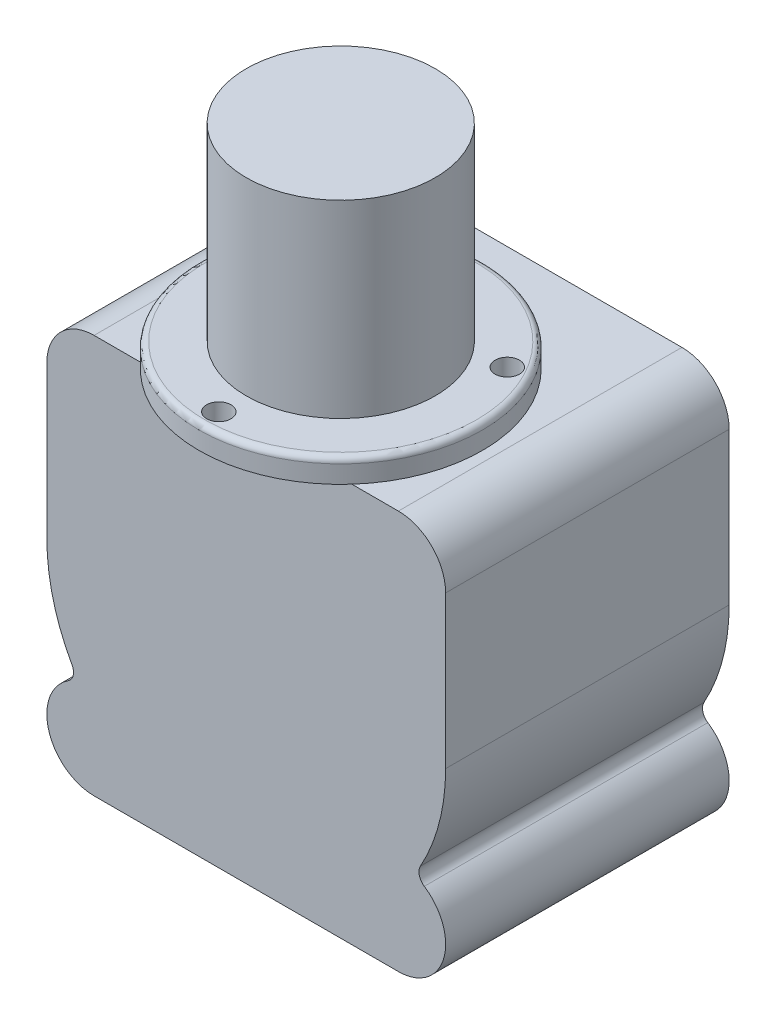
ISO-10303-21;
HEADER;
FILE_DESCRIPTION(('STEP AP214'),'2;1');
FILE_NAME('part.step','',(''),(''),'','','');
FILE_SCHEMA(('AUTOMOTIVE_DESIGN { 1 0 10303 214 1 1 1 1 }'));
ENDSEC;
DATA;
#1=APPLICATION_CONTEXT('core data for automotive mechanical design processes');
#2=APPLICATION_PROTOCOL_DEFINITION('international standard','automotive_design',2000,#1);
#3=PRODUCT_CONTEXT('',#1,'mechanical');
#4=PRODUCT('Part','Part','',(#3));
#5=PRODUCT_RELATED_PRODUCT_CATEGORY('part','',(#4));
#6=PRODUCT_DEFINITION_FORMATION('','',#4);
#7=PRODUCT_DEFINITION_CONTEXT('part definition',#1,'design');
#8=PRODUCT_DEFINITION('design','',#6,#7);
#9=PRODUCT_DEFINITION_SHAPE('','',#8);
#10=(LENGTH_UNIT() NAMED_UNIT(*) SI_UNIT(.MILLI.,.METRE.));
#11=(NAMED_UNIT(*) PLANE_ANGLE_UNIT() SI_UNIT($,.RADIAN.));
#12=(NAMED_UNIT(*) SI_UNIT($,.STERADIAN.) SOLID_ANGLE_UNIT());
#13=UNCERTAINTY_MEASURE_WITH_UNIT(LENGTH_MEASURE(1.E-05),#10,'distance_accuracy_value','');
#14=(GEOMETRIC_REPRESENTATION_CONTEXT(3) GLOBAL_UNCERTAINTY_ASSIGNED_CONTEXT((#13)) GLOBAL_UNIT_ASSIGNED_CONTEXT((#10,
#11,#12)) REPRESENTATION_CONTEXT('',''));
#15=CARTESIAN_POINT('',(0.,0.,0.));
#16=DIRECTION('',(0.,0.,1.));
#17=DIRECTION('',(1.,0.,0.));
#18=AXIS2_PLACEMENT_3D('',#15,#16,#17);
#19=CARTESIAN_POINT('',(-14.1880941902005,23.6220000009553,17.2085));
#20=DIRECTION('',(0.,1.,0.));
#21=DIRECTION('',(0.,0.,1.));
#22=AXIS2_PLACEMENT_3D('',#19,#20,#21);
#23=CONICAL_SURFACE('',#22,1.63829999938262,1.02974425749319);
#24=CARTESIAN_POINT('',(-14.1880941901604,22.6376100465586,17.2085));
#25=VERTEX_POINT('',#24);
#26=VERTEX_LOOP('',#25);
#27=FACE_BOUND('',#26,.T.);
#28=CARTESIAN_POINT('',(-14.1880941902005,23.622,17.2085));
#29=DIRECTION('',(0.,1.,0.));
#30=DIRECTION('',(0.,0.,1.));
#31=AXIS2_PLACEMENT_3D('',#28,#29,#30);
#32=CIRCLE('',#31,1.6383);
#33=CARTESIAN_POINT('',(-14.1880941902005,23.622,18.8468));
#34=VERTEX_POINT('',#33);
#35=EDGE_CURVE('E197',#34,#34,#32,.T.);
#36=ORIENTED_EDGE('',*,*,#35,.T.);
#37=EDGE_LOOP('',(#36));
#38=FACE_BOUND('',#37,.T.);
#39=ADVANCED_FACE('F16',(#27,#38),#23,.F.);
#40=CARTESIAN_POINT('',(14.1880941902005,23.6220000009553,17.2085));
#41=DIRECTION('',(0.,1.,0.));
#42=DIRECTION('',(0.,0.,1.));
#43=AXIS2_PLACEMENT_3D('',#40,#41,#42);
#44=CONICAL_SURFACE('',#43,1.63829999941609,1.02974425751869);
#45=CARTESIAN_POINT('',(14.1880941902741,22.6376100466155,17.2085));
#46=VERTEX_POINT('',#45);
#47=VERTEX_LOOP('',#46);
#48=FACE_BOUND('',#47,.T.);
#49=CARTESIAN_POINT('',(14.1880941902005,23.622,17.2085));
#50=DIRECTION('',(0.,1.,0.));
#51=DIRECTION('',(0.,0.,1.));
#52=AXIS2_PLACEMENT_3D('',#49,#50,#51);
#53=CIRCLE('',#52,1.6383);
#54=CARTESIAN_POINT('',(14.1880941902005,23.622,18.8468));
#55=VERTEX_POINT('',#54);
#56=EDGE_CURVE('E189',#55,#55,#53,.T.);
#57=ORIENTED_EDGE('',*,*,#56,.T.);
#58=EDGE_LOOP('',(#57));
#59=FACE_BOUND('',#58,.T.);
#60=ADVANCED_FACE('F269',(#48,#59),#44,.F.);
#61=CARTESIAN_POINT('',(0.,55.372,25.4));
#62=DIRECTION('',(0.,-1.,0.));
#63=DIRECTION('',(0.,0.,-1.));
#64=AXIS2_PLACEMENT_3D('',#61,#62,#63);
#65=PLANE('',#64);
#66=CARTESIAN_POINT('',(0.,55.372,25.4));
#67=DIRECTION('',(0.,1.,0.));
#68=DIRECTION('',(0.,0.,1.));
#69=AXIS2_PLACEMENT_3D('',#66,#67,#68);
#70=CIRCLE('',#69,12.7);
#71=CARTESIAN_POINT('',(0.,55.372,38.1));
#72=VERTEX_POINT('',#71);
#73=EDGE_CURVE('E19',#72,#72,#70,.F.);
#74=ORIENTED_EDGE('',*,*,#73,.F.);
#75=EDGE_LOOP('',(#74));
#76=FACE_BOUND('',#75,.T.);
#77=ADVANCED_FACE('F266',(#76),#65,.F.);
#78=CARTESIAN_POINT('',(-14.1880941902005,26.797,17.2085));
#79=DIRECTION('',(0.,1.,0.));
#80=DIRECTION('',(0.,0.,1.));
#81=AXIS2_PLACEMENT_3D('',#78,#79,#80);
#82=CYLINDRICAL_SURFACE('',#81,1.6383);
#83=ORIENTED_EDGE('',*,*,#35,.F.);
#84=EDGE_LOOP('',(#83));
#85=FACE_BOUND('',#84,.T.);
#86=CARTESIAN_POINT('',(-14.1880941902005,29.972,17.2085));
#87=DIRECTION('',(0.,1.,0.));
#88=DIRECTION('',(0.,0.,1.));
#89=AXIS2_PLACEMENT_3D('',#86,#87,#88);
#90=CIRCLE('',#89,1.6383);
#91=CARTESIAN_POINT('',(-14.1880941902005,29.972,18.8468));
#92=VERTEX_POINT('',#91);
#93=EDGE_CURVE('E257',#92,#92,#90,.T.);
#94=ORIENTED_EDGE('',*,*,#93,.T.);
#95=EDGE_LOOP('',(#94));
#96=FACE_BOUND('',#95,.T.);
#97=ADVANCED_FACE('F268',(#85,#96),#82,.F.);
#98=CARTESIAN_POINT('',(14.1880941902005,26.797,17.2085));
#99=DIRECTION('',(0.,1.,0.));
#100=DIRECTION('',(0.,0.,1.));
#101=AXIS2_PLACEMENT_3D('',#98,#99,#100);
#102=CYLINDRICAL_SURFACE('',#101,1.6383);
#103=ORIENTED_EDGE('',*,*,#56,.F.);
#104=EDGE_LOOP('',(#103));
#105=FACE_BOUND('',#104,.T.);
#106=CARTESIAN_POINT('',(14.1880941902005,29.972,17.2085));
#107=DIRECTION('',(0.,1.,0.));
#108=DIRECTION('',(0.,0.,1.));
#109=AXIS2_PLACEMENT_3D('',#106,#107,#108);
#110=CIRCLE('',#109,1.6383);
#111=CARTESIAN_POINT('',(14.1880941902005,29.972,18.8468));
#112=VERTEX_POINT('',#111);
#113=EDGE_CURVE('E255',#112,#112,#110,.T.);
#114=ORIENTED_EDGE('',*,*,#113,.T.);
#115=EDGE_LOOP('',(#114));
#116=FACE_BOUND('',#115,.T.);
#117=ADVANCED_FACE('F276',(#105,#116),#102,.F.);
#118=CARTESIAN_POINT('',(0.,29.972,25.4));
#119=DIRECTION('',(0.,1.,0.));
#120=DIRECTION('',(0.,0.,1.));
#121=AXIS2_PLACEMENT_3D('',#118,#119,#120);
#122=CYLINDRICAL_SURFACE('',#121,12.7);
#123=CARTESIAN_POINT('',(0.,29.972,25.4));
#124=DIRECTION('',(0.,1.,0.));
#125=DIRECTION('',(0.,0.,1.));
#126=AXIS2_PLACEMENT_3D('',#123,#124,#125);
#127=CIRCLE('',#126,12.7);
#128=CARTESIAN_POINT('',(0.,29.972,38.1));
#129=VERTEX_POINT('',#128);
#130=EDGE_CURVE('E252',#129,#129,#127,.T.);
#131=ORIENTED_EDGE('',*,*,#130,.T.);
#132=EDGE_LOOP('',(#131));
#133=FACE_BOUND('',#132,.T.);
#134=ORIENTED_EDGE('',*,*,#73,.T.);
#135=EDGE_LOOP('',(#134));
#136=FACE_BOUND('',#135,.T.);
#137=ADVANCED_FACE('F264',(#133,#136),#122,.T.);
#138=CARTESIAN_POINT('',(0.,29.972,25.4));
#139=DIRECTION('',(0.,-1.,0.));
#140=DIRECTION('',(0.,0.,-1.));
#141=AXIS2_PLACEMENT_3D('',#138,#139,#140);
#142=PLANE('',#141);
#143=ORIENTED_EDGE('',*,*,#130,.F.);
#144=EDGE_LOOP('',(#143));
#145=FACE_BOUND('',#144,.T.);
#146=CARTESIAN_POINT('',(0.,29.972,41.783));
#147=DIRECTION('',(0.,1.,0.));
#148=DIRECTION('',(0.,0.,1.));
#149=AXIS2_PLACEMENT_3D('',#146,#147,#148);
#150=CIRCLE('',#149,1.6383);
#151=CARTESIAN_POINT('',(0.,29.972,43.4213));
#152=VERTEX_POINT('',#151);
#153=EDGE_CURVE('E249',#152,#152,#150,.F.);
#154=ORIENTED_EDGE('',*,*,#153,.T.);
#155=EDGE_LOOP('',(#154));
#156=FACE_BOUND('',#155,.T.);
#157=ORIENTED_EDGE('',*,*,#113,.F.);
#158=EDGE_LOOP('',(#157));
#159=FACE_BOUND('',#158,.T.);
#160=ORIENTED_EDGE('',*,*,#93,.F.);
#161=EDGE_LOOP('',(#160));
#162=FACE_BOUND('',#161,.T.);
#163=CARTESIAN_POINT('',(0.,29.972,25.4));
#164=DIRECTION('',(0.,-1.,0.));
#165=DIRECTION('',(1.,0.,0.));
#166=AXIS2_PLACEMENT_3D('',#163,#164,#165);
#167=CIRCLE('',#166,18.25625);
#168=CARTESIAN_POINT('',(18.25625,29.972,25.4));
#169=VERTEX_POINT('',#168);
#170=EDGE_CURVE('E248',#169,#169,#167,.T.);
#171=ORIENTED_EDGE('',*,*,#170,.F.);
#172=EDGE_LOOP('',(#171));
#173=FACE_BOUND('',#172,.T.);
#174=ADVANCED_FACE('F343',(#145,#156,#159,#162,#173),#142,.F.);
#175=CARTESIAN_POINT('',(0.,26.797,41.783));
#176=DIRECTION('',(0.,1.,0.));
#177=DIRECTION('',(0.,0.,1.));
#178=AXIS2_PLACEMENT_3D('',#175,#176,#177);
#179=CYLINDRICAL_SURFACE('',#178,1.6383);
#180=ORIENTED_EDGE('',*,*,#153,.F.);
#181=EDGE_LOOP('',(#180));
#182=FACE_BOUND('',#181,.T.);
#183=CARTESIAN_POINT('',(0.,26.797,41.783));
#184=DIRECTION('',(0.,1.,0.));
#185=DIRECTION('',(0.,0.,1.));
#186=AXIS2_PLACEMENT_3D('',#183,#184,#185);
#187=CIRCLE('',#186,1.6383);
#188=CARTESIAN_POINT('',(0.,26.797,43.4213));
#189=VERTEX_POINT('',#188);
#190=EDGE_CURVE('E124',#189,#189,#187,.T.);
#191=ORIENTED_EDGE('',*,*,#190,.F.);
#192=EDGE_LOOP('',(#191));
#193=FACE_BOUND('',#192,.T.);
#194=ADVANCED_FACE('F179',(#182,#193),#179,.F.);
#195=CARTESIAN_POINT('',(0.,29.17825,25.4));
#196=DIRECTION('',(0.,-1.,0.));
#197=DIRECTION('',(0.,0.,-1.));
#198=AXIS2_PLACEMENT_3D('',#195,#196,#197);
#199=TOROIDAL_SURFACE('',#198,18.25625,0.79375);
#200=CARTESIAN_POINT('',(0.,29.17825,25.4));
#201=DIRECTION('',(0.,1.,0.));
#202=DIRECTION('',(0.,0.,1.));
#203=AXIS2_PLACEMENT_3D('',#200,#201,#202);
#204=CIRCLE('',#203,19.05);
#205=CARTESIAN_POINT('',(0.,29.17825,44.45));
#206=VERTEX_POINT('',#205);
#207=EDGE_CURVE('E123',#206,#206,#204,.F.);
#208=ORIENTED_EDGE('',*,*,#207,.F.);
#209=EDGE_LOOP('',(#208));
#210=FACE_BOUND('',#209,.T.);
#211=ORIENTED_EDGE('',*,*,#170,.T.);
#212=EDGE_LOOP('',(#211));
#213=FACE_BOUND('',#212,.T.);
#214=ADVANCED_FACE('F174',(#210,#213),#199,.T.);
#215=CARTESIAN_POINT('',(0.,26.797,25.4));
#216=DIRECTION('',(0.,-1.,0.));
#217=DIRECTION('',(0.,0.,-1.));
#218=AXIS2_PLACEMENT_3D('',#215,#216,#217);
#219=PLANE('',#218);
#220=ORIENTED_EDGE('',*,*,#190,.T.);
#221=EDGE_LOOP('',(#220));
#222=FACE_BOUND('',#221,.T.);
#223=DIRECTION('',(1.,0.,0.));
#224=VECTOR('',#223,1.);
#225=CARTESIAN_POINT('',(0.,26.797,38.1));
#226=LINE('',#225,#224);
#227=CARTESIAN_POINT('',(14.1990316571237,26.797,38.1));
#228=VERTEX_POINT('',#227);
#229=CARTESIAN_POINT('',(-14.1990316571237,26.797,38.1));
#230=VERTEX_POINT('',#229);
#231=EDGE_CURVE('E112',#228,#230,#226,.F.);
#232=ORIENTED_EDGE('',*,*,#231,.F.);
#233=CARTESIAN_POINT('',(0.,26.797,25.4));
#234=DIRECTION('',(0.,1.,0.));
#235=DIRECTION('',(0.,0.,1.));
#236=AXIS2_PLACEMENT_3D('',#233,#234,#235);
#237=CIRCLE('',#236,19.05);
#238=EDGE_CURVE('E117',#230,#228,#237,.T.);
#239=ORIENTED_EDGE('',*,*,#238,.F.);
#240=EDGE_LOOP('',(#232,#239));
#241=FACE_BOUND('',#240,.T.);
#242=ADVANCED_FACE('F134',(#222,#241),#219,.T.);
#243=CARTESIAN_POINT('',(0.,26.797,25.4));
#244=DIRECTION('',(0.,1.,0.));
#245=DIRECTION('',(0.,0.,1.));
#246=AXIS2_PLACEMENT_3D('',#243,#244,#245);
#247=CYLINDRICAL_SURFACE('',#246,19.05);
#248=ORIENTED_EDGE('',*,*,#207,.T.);
#249=EDGE_LOOP('',(#248));
#250=FACE_BOUND('',#249,.T.);
#251=CARTESIAN_POINT('',(0.,26.797,25.4));
#252=DIRECTION('',(0.,1.,0.));
#253=DIRECTION('',(0.,0.,1.));
#254=AXIS2_PLACEMENT_3D('',#251,#252,#253);
#255=CIRCLE('',#254,19.05);
#256=EDGE_CURVE('E120',#230,#228,#255,.F.);
#257=ORIENTED_EDGE('',*,*,#256,.F.);
#258=ORIENTED_EDGE('',*,*,#238,.T.);
#259=EDGE_LOOP('',(#257,#258));
#260=FACE_BOUND('',#259,.T.);
#261=ADVANCED_FACE('F119',(#250,#260),#247,.T.);
#262=CARTESIAN_POINT('',(0.,0.,38.1));
#263=DIRECTION('',(0.,0.,1.));
#264=DIRECTION('',(1.,0.,0.));
#265=AXIS2_PLACEMENT_3D('',#262,#263,#264);
#266=PLANE('',#265);
#267=CARTESIAN_POINT('',(-20.447,-20.447,38.1));
#268=DIRECTION('',(0.,0.,-1.));
#269=DIRECTION('',(-1.,0.,0.));
#270=AXIS2_PLACEMENT_3D('',#267,#268,#269);
#271=CIRCLE('',#270,6.35);
#272=CARTESIAN_POINT('',(-20.447,-26.797,38.1));
#273=VERTEX_POINT('',#272);
#274=CARTESIAN_POINT('',(-23.9286348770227,-15.1365651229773,38.1));
#275=VERTEX_POINT('',#274);
#276=EDGE_CURVE('E158',#273,#275,#271,.T.);
#277=ORIENTED_EDGE('',*,*,#276,.F.);
#278=DIRECTION('',(1.,0.,0.));
#279=VECTOR('',#278,1.);
#280=CARTESIAN_POINT('',(26.797,-26.797,38.1));
#281=LINE('',#280,#279);
#282=CARTESIAN_POINT('',(20.447,-26.797,38.1));
#283=VERTEX_POINT('',#282);
#284=EDGE_CURVE('E155',#283,#273,#281,.F.);
#285=ORIENTED_EDGE('',*,*,#284,.F.);
#286=CARTESIAN_POINT('',(20.447,-20.447,38.1));
#287=DIRECTION('',(0.,0.,-1.));
#288=DIRECTION('',(-1.,0.,0.));
#289=AXIS2_PLACEMENT_3D('',#286,#287,#288);
#290=CIRCLE('',#289,6.35);
#291=CARTESIAN_POINT('',(23.9286348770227,-15.1365651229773,38.1));
#292=VERTEX_POINT('',#291);
#293=EDGE_CURVE('E228',#292,#283,#290,.T.);
#294=ORIENTED_EDGE('',*,*,#293,.F.);
#295=CARTESIAN_POINT('',(24.7990435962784,-13.8089564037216,38.1));
#296=DIRECTION('',(0.,0.,-1.));
#297=DIRECTION('',(-1.,0.,0.));
#298=AXIS2_PLACEMENT_3D('',#295,#296,#297);
#299=CIRCLE('',#298,1.5875);
#300=CARTESIAN_POINT('',(23.4120724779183,-13.0366434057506,38.1));
#301=VERTEX_POINT('',#300);
#302=EDGE_CURVE('E135',#292,#301,#299,.T.);
#303=ORIENTED_EDGE('',*,*,#302,.T.);
#304=CARTESIAN_POINT('',(0.,0.,38.1));
#305=DIRECTION('',(0.,0.,-1.));
#306=DIRECTION('',(-1.,0.,0.));
#307=AXIS2_PLACEMENT_3D('',#304,#305,#306);
#308=CIRCLE('',#307,26.797);
#309=CARTESIAN_POINT('',(26.797,0.,38.1));
#310=VERTEX_POINT('',#309);
#311=EDGE_CURVE('E152',#310,#301,#308,.T.);
#312=ORIENTED_EDGE('',*,*,#311,.F.);
#313=DIRECTION('',(0.,1.,0.));
#314=VECTOR('',#313,1.);
#315=CARTESIAN_POINT('',(26.797,26.797,38.1));
#316=LINE('',#315,#314);
#317=CARTESIAN_POINT('',(26.797,20.447,38.1));
#318=VERTEX_POINT('',#317);
#319=EDGE_CURVE('E151',#318,#310,#316,.F.);
#320=ORIENTED_EDGE('',*,*,#319,.F.);
#321=CARTESIAN_POINT('',(20.447,20.447,38.1));
#322=DIRECTION('',(0.,0.,1.));
#323=DIRECTION('',(1.,0.,0.));
#324=AXIS2_PLACEMENT_3D('',#321,#322,#323);
#325=CIRCLE('',#324,6.35);
#326=CARTESIAN_POINT('',(20.447,26.797,38.1));
#327=VERTEX_POINT('',#326);
#328=EDGE_CURVE('E140',#327,#318,#325,.F.);
#329=ORIENTED_EDGE('',*,*,#328,.F.);
#330=DIRECTION('',(1.,0.,0.));
#331=VECTOR('',#330,1.);
#332=CARTESIAN_POINT('',(-26.797,26.797,38.1));
#333=LINE('',#332,#331);
#334=EDGE_CURVE('E129',#228,#327,#333,.T.);
#335=ORIENTED_EDGE('',*,*,#334,.F.);
#336=ORIENTED_EDGE('',*,*,#231,.T.);
#337=DIRECTION('',(1.,0.,0.));
#338=VECTOR('',#337,1.);
#339=CARTESIAN_POINT('',(-26.797,26.797,38.1));
#340=LINE('',#339,#338);
#341=CARTESIAN_POINT('',(-20.447,26.797,38.1));
#342=VERTEX_POINT('',#341);
#343=EDGE_CURVE('E131',#342,#230,#340,.T.);
#344=ORIENTED_EDGE('',*,*,#343,.F.);
#345=CARTESIAN_POINT('',(-20.447,20.447,38.1));
#346=DIRECTION('',(0.,0.,1.));
#347=DIRECTION('',(1.,0.,0.));
#348=AXIS2_PLACEMENT_3D('',#345,#346,#347);
#349=CIRCLE('',#348,6.35);
#350=CARTESIAN_POINT('',(-26.797,20.447,38.1));
#351=VERTEX_POINT('',#350);
#352=EDGE_CURVE('E240',#351,#342,#349,.F.);
#353=ORIENTED_EDGE('',*,*,#352,.F.);
#354=DIRECTION('',(0.,1.,0.));
#355=VECTOR('',#354,1.);
#356=CARTESIAN_POINT('',(-26.797,-26.797,38.1));
#357=LINE('',#356,#355);
#358=CARTESIAN_POINT('',(-26.797,0.,38.1));
#359=VERTEX_POINT('',#358);
#360=EDGE_CURVE('E159',#359,#351,#357,.T.);
#361=ORIENTED_EDGE('',*,*,#360,.F.);
#362=CARTESIAN_POINT('',(0.,0.,38.1));
#363=DIRECTION('',(0.,0.,-1.));
#364=DIRECTION('',(-1.,0.,0.));
#365=AXIS2_PLACEMENT_3D('',#362,#363,#364);
#366=CIRCLE('',#365,26.797);
#367=CARTESIAN_POINT('',(-23.4120724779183,-13.0366434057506,38.1));
#368=VERTEX_POINT('',#367);
#369=EDGE_CURVE('E237',#368,#359,#366,.T.);
#370=ORIENTED_EDGE('',*,*,#369,.F.);
#371=CARTESIAN_POINT('',(-24.7990435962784,-13.8089564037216,38.1));
#372=DIRECTION('',(0.,0.,-1.));
#373=DIRECTION('',(-1.,0.,0.));
#374=AXIS2_PLACEMENT_3D('',#371,#372,#373);
#375=CIRCLE('',#374,1.5875);
#376=EDGE_CURVE('E234',#368,#275,#375,.T.);
#377=ORIENTED_EDGE('',*,*,#376,.T.);
#378=EDGE_LOOP('',(#277,#285,#294,#303,#312,#320,#329,#335,#336,#344,#353,#361,#370,#377));
#379=FACE_BOUND('',#378,.T.);
#380=ADVANCED_FACE('F138',(#379),#266,.T.);
#381=CARTESIAN_POINT('',(24.7990435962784,-13.8089564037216,38.1));
#382=DIRECTION('',(0.,0.,-1.));
#383=DIRECTION('',(-1.,0.,0.));
#384=AXIS2_PLACEMENT_3D('',#381,#382,#383);
#385=CYLINDRICAL_SURFACE('',#384,1.5875);
#386=DIRECTION('',(0.,0.,-1.));
#387=VECTOR('',#386,1.);
#388=CARTESIAN_POINT('',(23.9286348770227,-15.1365651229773,38.1));
#389=LINE('',#388,#387);
#390=CARTESIAN_POINT('',(23.9286348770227,-15.1365651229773,0.));
#391=VERTEX_POINT('',#390);
#392=EDGE_CURVE('E230',#391,#292,#389,.F.);
#393=ORIENTED_EDGE('',*,*,#392,.F.);
#394=CARTESIAN_POINT('',(24.7990435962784,-13.8089564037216,0.));
#395=DIRECTION('',(0.,0.,-1.));
#396=DIRECTION('',(-1.,0.,0.));
#397=AXIS2_PLACEMENT_3D('',#394,#395,#396);
#398=CIRCLE('',#397,1.5875);
#399=CARTESIAN_POINT('',(23.4120724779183,-13.0366434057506,0.));
#400=VERTEX_POINT('',#399);
#401=EDGE_CURVE('E225',#391,#400,#398,.T.);
#402=ORIENTED_EDGE('',*,*,#401,.T.);
#403=DIRECTION('',(0.,0.,-1.));
#404=VECTOR('',#403,1.);
#405=CARTESIAN_POINT('',(23.4120724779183,-13.0366434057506,38.1));
#406=LINE('',#405,#404);
#407=EDGE_CURVE('E153',#301,#400,#406,.T.);
#408=ORIENTED_EDGE('',*,*,#407,.F.);
#409=ORIENTED_EDGE('',*,*,#302,.F.);
#410=EDGE_LOOP('',(#393,#402,#408,#409));
#411=FACE_BOUND('',#410,.T.);
#412=ADVANCED_FACE('F328',(#411),#385,.F.);
#413=CARTESIAN_POINT('',(0.,0.,38.1));
#414=DIRECTION('',(0.,0.,-1.));
#415=DIRECTION('',(-1.,0.,0.));
#416=AXIS2_PLACEMENT_3D('',#413,#414,#415);
#417=CYLINDRICAL_SURFACE('',#416,26.797);
#418=DIRECTION('',(0.,0.,-1.));
#419=VECTOR('',#418,1.);
#420=CARTESIAN_POINT('',(26.797,0.,0.));
#421=LINE('',#420,#419);
#422=CARTESIAN_POINT('',(26.797,0.,0.));
#423=VERTEX_POINT('',#422);
#424=EDGE_CURVE('E149',#310,#423,#421,.T.);
#425=ORIENTED_EDGE('',*,*,#424,.F.);
#426=ORIENTED_EDGE('',*,*,#311,.T.);
#427=ORIENTED_EDGE('',*,*,#407,.T.);
#428=CARTESIAN_POINT('',(0.,0.,0.));
#429=DIRECTION('',(0.,0.,-1.));
#430=DIRECTION('',(-1.,0.,0.));
#431=AXIS2_PLACEMENT_3D('',#428,#429,#430);
#432=CIRCLE('',#431,26.797);
#433=EDGE_CURVE('E222',#400,#423,#432,.F.);
#434=ORIENTED_EDGE('',*,*,#433,.T.);
#435=EDGE_LOOP('',(#425,#426,#427,#434));
#436=FACE_BOUND('',#435,.T.);
#437=ADVANCED_FACE('F324',(#436),#417,.T.);
#438=CARTESIAN_POINT('',(26.797,26.797,0.));
#439=DIRECTION('',(1.,0.,0.));
#440=DIRECTION('',(0.,0.,-1.));
#441=AXIS2_PLACEMENT_3D('',#438,#439,#440);
#442=PLANE('',#441);
#443=DIRECTION('',(0.,0.,1.));
#444=VECTOR('',#443,1.);
#445=CARTESIAN_POINT('',(26.797,20.447,0.));
#446=LINE('',#445,#444);
#447=CARTESIAN_POINT('',(26.797,20.447,0.));
#448=VERTEX_POINT('',#447);
#449=EDGE_CURVE('E132',#318,#448,#446,.F.);
#450=ORIENTED_EDGE('',*,*,#449,.F.);
#451=ORIENTED_EDGE('',*,*,#319,.T.);
#452=ORIENTED_EDGE('',*,*,#424,.T.);
#453=DIRECTION('',(0.,1.,0.));
#454=VECTOR('',#453,1.);
#455=CARTESIAN_POINT('',(26.797,0.,0.));
#456=LINE('',#455,#454);
#457=EDGE_CURVE('E221',#423,#448,#456,.T.);
#458=ORIENTED_EDGE('',*,*,#457,.T.);
#459=EDGE_LOOP('',(#450,#451,#452,#458));
#460=FACE_BOUND('',#459,.T.);
#461=ADVANCED_FACE('F320',(#460),#442,.T.);
#462=CARTESIAN_POINT('',(20.447,20.447,0.));
#463=DIRECTION('',(0.,0.,1.));
#464=DIRECTION('',(1.,0.,0.));
#465=AXIS2_PLACEMENT_3D('',#462,#463,#464);
#466=CYLINDRICAL_SURFACE('',#465,6.35);
#467=CARTESIAN_POINT('',(20.447,20.447,0.));
#468=DIRECTION('',(0.,0.,1.));
#469=DIRECTION('',(1.,0.,0.));
#470=AXIS2_PLACEMENT_3D('',#467,#468,#469);
#471=CIRCLE('',#470,6.35);
#472=CARTESIAN_POINT('',(20.447,26.797,0.));
#473=VERTEX_POINT('',#472);
#474=EDGE_CURVE('E218',#448,#473,#471,.T.);
#475=ORIENTED_EDGE('',*,*,#474,.T.);
#476=DIRECTION('',(0.,0.,1.));
#477=VECTOR('',#476,1.);
#478=CARTESIAN_POINT('',(20.447,26.797,0.));
#479=LINE('',#478,#477);
#480=EDGE_CURVE('E142',#327,#473,#479,.F.);
#481=ORIENTED_EDGE('',*,*,#480,.F.);
#482=ORIENTED_EDGE('',*,*,#328,.T.);
#483=ORIENTED_EDGE('',*,*,#449,.T.);
#484=EDGE_LOOP('',(#475,#481,#482,#483));
#485=FACE_BOUND('',#484,.T.);
#486=ADVANCED_FACE('F317',(#485),#466,.T.);
#487=CARTESIAN_POINT('',(-26.797,26.797,0.));
#488=DIRECTION('',(0.,1.,0.));
#489=DIRECTION('',(0.,0.,1.));
#490=AXIS2_PLACEMENT_3D('',#487,#488,#489);
#491=PLANE('',#490);
#492=DIRECTION('',(0.,0.,1.));
#493=VECTOR('',#492,1.);
#494=CARTESIAN_POINT('',(-20.447,26.797,0.));
#495=LINE('',#494,#493);
#496=CARTESIAN_POINT('',(-20.447,26.797,0.));
#497=VERTEX_POINT('',#496);
#498=EDGE_CURVE('E161',#342,#497,#495,.F.);
#499=ORIENTED_EDGE('',*,*,#498,.F.);
#500=ORIENTED_EDGE('',*,*,#343,.T.);
#501=ORIENTED_EDGE('',*,*,#256,.T.);
#502=ORIENTED_EDGE('',*,*,#334,.T.);
#503=ORIENTED_EDGE('',*,*,#480,.T.);
#504=DIRECTION('',(1.,0.,0.));
#505=VECTOR('',#504,1.);
#506=CARTESIAN_POINT('',(0.,26.797,0.));
#507=LINE('',#506,#505);
#508=EDGE_CURVE('E217',#473,#497,#507,.F.);
#509=ORIENTED_EDGE('',*,*,#508,.T.);
#510=EDGE_LOOP('',(#499,#500,#501,#502,#503,#509));
#511=FACE_BOUND('',#510,.T.);
#512=ADVANCED_FACE('F128',(#511),#491,.T.);
#513=CARTESIAN_POINT('',(-20.447,20.447,0.));
#514=DIRECTION('',(0.,0.,1.));
#515=DIRECTION('',(1.,0.,0.));
#516=AXIS2_PLACEMENT_3D('',#513,#514,#515);
#517=CYLINDRICAL_SURFACE('',#516,6.35);
#518=CARTESIAN_POINT('',(-20.447,20.447,0.));
#519=DIRECTION('',(0.,0.,1.));
#520=DIRECTION('',(1.,0.,0.));
#521=AXIS2_PLACEMENT_3D('',#518,#519,#520);
#522=CIRCLE('',#521,6.35);
#523=CARTESIAN_POINT('',(-26.797,20.447,0.));
#524=VERTEX_POINT('',#523);
#525=EDGE_CURVE('E214',#497,#524,#522,.T.);
#526=ORIENTED_EDGE('',*,*,#525,.T.);
#527=DIRECTION('',(0.,0.,1.));
#528=VECTOR('',#527,1.);
#529=CARTESIAN_POINT('',(-26.797,20.447,0.));
#530=LINE('',#529,#528);
#531=EDGE_CURVE('E160',#351,#524,#530,.F.);
#532=ORIENTED_EDGE('',*,*,#531,.F.);
#533=ORIENTED_EDGE('',*,*,#352,.T.);
#534=ORIENTED_EDGE('',*,*,#498,.T.);
#535=EDGE_LOOP('',(#526,#532,#533,#534));
#536=FACE_BOUND('',#535,.T.);
#537=ADVANCED_FACE('F310',(#536),#517,.T.);
#538=CARTESIAN_POINT('',(-26.797,-26.797,0.));
#539=DIRECTION('',(-1.,0.,0.));
#540=DIRECTION('',(0.,0.,1.));
#541=AXIS2_PLACEMENT_3D('',#538,#539,#540);
#542=PLANE('',#541);
#543=ORIENTED_EDGE('',*,*,#531,.T.);
#544=DIRECTION('',(0.,1.,0.));
#545=VECTOR('',#544,1.);
#546=CARTESIAN_POINT('',(-26.797,0.,0.));
#547=LINE('',#546,#545);
#548=CARTESIAN_POINT('',(-26.797,0.,0.));
#549=VERTEX_POINT('',#548);
#550=EDGE_CURVE('E213',#524,#549,#547,.F.);
#551=ORIENTED_EDGE('',*,*,#550,.T.);
#552=DIRECTION('',(0.,0.,-1.));
#553=VECTOR('',#552,1.);
#554=CARTESIAN_POINT('',(-26.797,0.,38.1));
#555=LINE('',#554,#553);
#556=EDGE_CURVE('E239',#359,#549,#555,.T.);
#557=ORIENTED_EDGE('',*,*,#556,.F.);
#558=ORIENTED_EDGE('',*,*,#360,.T.);
#559=EDGE_LOOP('',(#543,#551,#557,#558));
#560=FACE_BOUND('',#559,.T.);
#561=ADVANCED_FACE('F306',(#560),#542,.T.);
#562=CARTESIAN_POINT('',(0.,0.,38.1));
#563=DIRECTION('',(0.,0.,-1.));
#564=DIRECTION('',(-1.,0.,0.));
#565=AXIS2_PLACEMENT_3D('',#562,#563,#564);
#566=CYLINDRICAL_SURFACE('',#565,26.797);
#567=ORIENTED_EDGE('',*,*,#556,.T.);
#568=CARTESIAN_POINT('',(0.,0.,0.));
#569=DIRECTION('',(0.,0.,-1.));
#570=DIRECTION('',(-1.,0.,0.));
#571=AXIS2_PLACEMENT_3D('',#568,#569,#570);
#572=CIRCLE('',#571,26.797);
#573=CARTESIAN_POINT('',(-23.4120724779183,-13.0366434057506,0.));
#574=VERTEX_POINT('',#573);
#575=EDGE_CURVE('E210',#549,#574,#572,.F.);
#576=ORIENTED_EDGE('',*,*,#575,.T.);
#577=DIRECTION('',(0.,0.,-1.));
#578=VECTOR('',#577,1.);
#579=CARTESIAN_POINT('',(-23.4120724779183,-13.0366434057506,38.1));
#580=LINE('',#579,#578);
#581=EDGE_CURVE('E236',#574,#368,#580,.F.);
#582=ORIENTED_EDGE('',*,*,#581,.T.);
#583=ORIENTED_EDGE('',*,*,#369,.T.);
#584=EDGE_LOOP('',(#567,#576,#582,#583));
#585=FACE_BOUND('',#584,.T.);
#586=ADVANCED_FACE('F302',(#585),#566,.T.);
#587=CARTESIAN_POINT('',(-24.7990435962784,-13.8089564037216,38.1));
#588=DIRECTION('',(0.,0.,-1.));
#589=DIRECTION('',(-1.,0.,0.));
#590=AXIS2_PLACEMENT_3D('',#587,#588,#589);
#591=CYLINDRICAL_SURFACE('',#590,1.5875);
#592=ORIENTED_EDGE('',*,*,#581,.F.);
#593=CARTESIAN_POINT('',(-24.7990435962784,-13.8089564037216,0.));
#594=DIRECTION('',(0.,0.,-1.));
#595=DIRECTION('',(-1.,0.,0.));
#596=AXIS2_PLACEMENT_3D('',#593,#594,#595);
#597=CIRCLE('',#596,1.5875);
#598=CARTESIAN_POINT('',(-23.9286348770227,-15.1365651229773,0.));
#599=VERTEX_POINT('',#598);
#600=EDGE_CURVE('E207',#574,#599,#597,.T.);
#601=ORIENTED_EDGE('',*,*,#600,.T.);
#602=DIRECTION('',(0.,0.,-1.));
#603=VECTOR('',#602,1.);
#604=CARTESIAN_POINT('',(-23.9286348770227,-15.1365651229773,38.1));
#605=LINE('',#604,#603);
#606=EDGE_CURVE('E233',#275,#599,#605,.T.);
#607=ORIENTED_EDGE('',*,*,#606,.F.);
#608=ORIENTED_EDGE('',*,*,#376,.F.);
#609=EDGE_LOOP('',(#592,#601,#607,#608));
#610=FACE_BOUND('',#609,.T.);
#611=ADVANCED_FACE('F298',(#610),#591,.F.);
#612=CARTESIAN_POINT('',(-20.447,-20.447,38.1));
#613=DIRECTION('',(0.,0.,-1.));
#614=DIRECTION('',(-1.,0.,0.));
#615=AXIS2_PLACEMENT_3D('',#612,#613,#614);
#616=CYLINDRICAL_SURFACE('',#615,6.35);
#617=DIRECTION('',(0.,0.,-1.));
#618=VECTOR('',#617,1.);
#619=CARTESIAN_POINT('',(-20.447,-26.797,0.));
#620=LINE('',#619,#618);
#621=CARTESIAN_POINT('',(-20.447,-26.797,0.));
#622=VERTEX_POINT('',#621);
#623=EDGE_CURVE('E157',#273,#622,#620,.T.);
#624=ORIENTED_EDGE('',*,*,#623,.F.);
#625=ORIENTED_EDGE('',*,*,#276,.T.);
#626=ORIENTED_EDGE('',*,*,#606,.T.);
#627=CARTESIAN_POINT('',(-20.447,-20.447,0.));
#628=DIRECTION('',(0.,0.,-1.));
#629=DIRECTION('',(-1.,0.,0.));
#630=AXIS2_PLACEMENT_3D('',#627,#628,#629);
#631=CIRCLE('',#630,6.35);
#632=EDGE_CURVE('E204',#599,#622,#631,.F.);
#633=ORIENTED_EDGE('',*,*,#632,.T.);
#634=EDGE_LOOP('',(#624,#625,#626,#633));
#635=FACE_BOUND('',#634,.T.);
#636=ADVANCED_FACE('F294',(#635),#616,.T.);
#637=CARTESIAN_POINT('',(26.797,-26.797,0.));
#638=DIRECTION('',(0.,-1.,0.));
#639=DIRECTION('',(0.,0.,-1.));
#640=AXIS2_PLACEMENT_3D('',#637,#638,#639);
#641=PLANE('',#640);
#642=ORIENTED_EDGE('',*,*,#623,.T.);
#643=DIRECTION('',(1.,0.,0.));
#644=VECTOR('',#643,1.);
#645=CARTESIAN_POINT('',(0.,-26.797,0.));
#646=LINE('',#645,#644);
#647=CARTESIAN_POINT('',(20.447,-26.797,0.));
#648=VERTEX_POINT('',#647);
#649=EDGE_CURVE('E25',#622,#648,#646,.T.);
#650=ORIENTED_EDGE('',*,*,#649,.T.);
#651=DIRECTION('',(0.,0.,-1.));
#652=VECTOR('',#651,1.);
#653=CARTESIAN_POINT('',(20.447,-26.797,38.1));
#654=LINE('',#653,#652);
#655=EDGE_CURVE('E33',#283,#648,#654,.T.);
#656=ORIENTED_EDGE('',*,*,#655,.F.);
#657=ORIENTED_EDGE('',*,*,#284,.T.);
#658=EDGE_LOOP('',(#642,#650,#656,#657));
#659=FACE_BOUND('',#658,.T.);
#660=ADVANCED_FACE('F288',(#659),#641,.T.);
#661=CARTESIAN_POINT('',(20.447,-20.447,38.1));
#662=DIRECTION('',(0.,0.,-1.));
#663=DIRECTION('',(-1.,0.,0.));
#664=AXIS2_PLACEMENT_3D('',#661,#662,#663);
#665=CYLINDRICAL_SURFACE('',#664,6.35);
#666=ORIENTED_EDGE('',*,*,#655,.T.);
#667=CARTESIAN_POINT('',(20.447,-20.447,0.));
#668=DIRECTION('',(0.,0.,-1.));
#669=DIRECTION('',(-1.,0.,0.));
#670=AXIS2_PLACEMENT_3D('',#667,#668,#669);
#671=CIRCLE('',#670,6.35);
#672=EDGE_CURVE('E11',#648,#391,#671,.F.);
#673=ORIENTED_EDGE('',*,*,#672,.T.);
#674=ORIENTED_EDGE('',*,*,#392,.T.);
#675=ORIENTED_EDGE('',*,*,#293,.T.);
#676=EDGE_LOOP('',(#666,#673,#674,#675));
#677=FACE_BOUND('',#676,.T.);
#678=ADVANCED_FACE('F282',(#677),#665,.T.);
#679=CARTESIAN_POINT('',(0.,0.,0.));
#680=DIRECTION('',(0.,0.,1.));
#681=DIRECTION('',(1.,0.,0.));
#682=AXIS2_PLACEMENT_3D('',#679,#680,#681);
#683=PLANE('',#682);
#684=ORIENTED_EDGE('',*,*,#649,.F.);
#685=ORIENTED_EDGE('',*,*,#632,.F.);
#686=ORIENTED_EDGE('',*,*,#600,.F.);
#687=ORIENTED_EDGE('',*,*,#575,.F.);
#688=ORIENTED_EDGE('',*,*,#550,.F.);
#689=ORIENTED_EDGE('',*,*,#525,.F.);
#690=ORIENTED_EDGE('',*,*,#508,.F.);
#691=ORIENTED_EDGE('',*,*,#474,.F.);
#692=ORIENTED_EDGE('',*,*,#457,.F.);
#693=ORIENTED_EDGE('',*,*,#433,.F.);
#694=ORIENTED_EDGE('',*,*,#401,.F.);
#695=ORIENTED_EDGE('',*,*,#672,.F.);
#696=EDGE_LOOP('',(#684,#685,#686,#687,#688,#689,#690,#691,#692,#693,#694,#695));
#697=FACE_BOUND('',#696,.T.);
#698=ADVANCED_FACE('F280',(#697),#683,.F.);
#699=CLOSED_SHELL('',(#39,#60,#77,#97,#117,#137,#174,#194,#214,#242,#261,#380,#412,#437,#461,
#486,#512,#537,#561,#586,#611,#636,#660,#678,#698));
#700=MANIFOLD_SOLID_BREP('B1',#699);
#701=ADVANCED_BREP_SHAPE_REPRESENTATION('',(#18,#700),#14);
#702=SHAPE_DEFINITION_REPRESENTATION(#9,#701);
ENDSEC;
END-ISO-10303-21;
